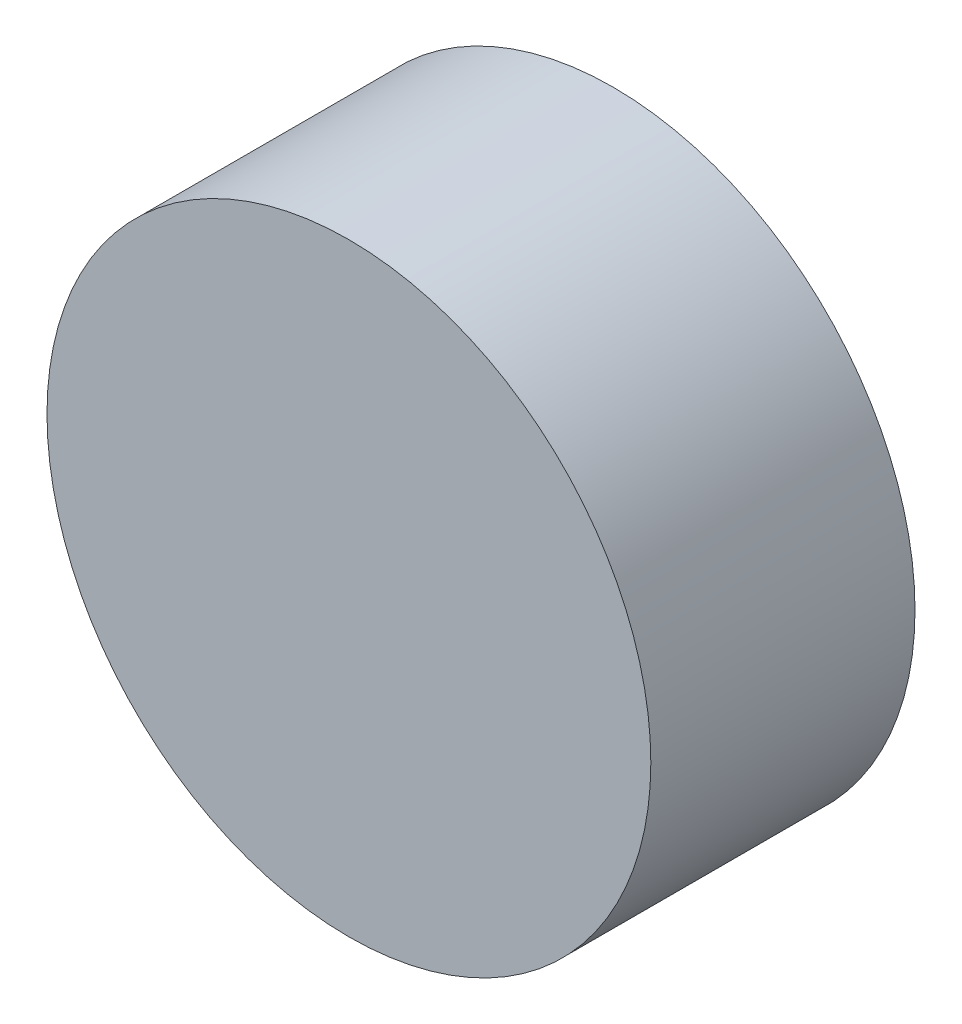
ISO-10303-21;
HEADER;
FILE_DESCRIPTION(('STEP AP214'),'2;1');
FILE_NAME('part.step','',(''),(''),'','','');
FILE_SCHEMA(('AUTOMOTIVE_DESIGN { 1 0 10303 214 1 1 1 1 }'));
ENDSEC;
DATA;
#1=APPLICATION_CONTEXT('core data for automotive mechanical design processes');
#2=APPLICATION_PROTOCOL_DEFINITION('international standard','automotive_design',2000,#1);
#3=PRODUCT_CONTEXT('',#1,'mechanical');
#4=PRODUCT('Part','Part','',(#3));
#5=PRODUCT_RELATED_PRODUCT_CATEGORY('part','',(#4));
#6=PRODUCT_DEFINITION_FORMATION('','',#4);
#7=PRODUCT_DEFINITION_CONTEXT('part definition',#1,'design');
#8=PRODUCT_DEFINITION('design','',#6,#7);
#9=PRODUCT_DEFINITION_SHAPE('','',#8);
#10=(LENGTH_UNIT() NAMED_UNIT(*) SI_UNIT(.MILLI.,.METRE.));
#11=(NAMED_UNIT(*) PLANE_ANGLE_UNIT() SI_UNIT($,.RADIAN.));
#12=(NAMED_UNIT(*) SI_UNIT($,.STERADIAN.) SOLID_ANGLE_UNIT());
#13=UNCERTAINTY_MEASURE_WITH_UNIT(LENGTH_MEASURE(1.E-05),#10,'distance_accuracy_value','');
#14=(GEOMETRIC_REPRESENTATION_CONTEXT(3) GLOBAL_UNCERTAINTY_ASSIGNED_CONTEXT((#13)) GLOBAL_UNIT_ASSIGNED_CONTEXT((#10,
#11,#12)) REPRESENTATION_CONTEXT('',''));
#15=CARTESIAN_POINT('',(0.,0.,0.));
#16=DIRECTION('',(0.,0.,1.));
#17=DIRECTION('',(1.,0.,0.));
#18=AXIS2_PLACEMENT_3D('',#15,#16,#17);
#19=CARTESIAN_POINT('',(0.,0.,3.5));
#20=DIRECTION('',(0.,0.,-1.));
#21=DIRECTION('',(-1.,0.,0.));
#22=AXIS2_PLACEMENT_3D('',#19,#20,#21);
#23=CYLINDRICAL_SURFACE('',#22,4.);
#24=CARTESIAN_POINT('',(0.,0.,3.5));
#25=DIRECTION('',(0.,0.,1.));
#26=DIRECTION('',(1.,0.,0.));
#27=AXIS2_PLACEMENT_3D('',#24,#25,#26);
#28=CIRCLE('',#27,4.);
#29=CARTESIAN_POINT('',(4.,0.,3.5));
#30=VERTEX_POINT('',#29);
#31=EDGE_CURVE('E10',#30,#30,#28,.T.);
#32=ORIENTED_EDGE('',*,*,#31,.F.);
#33=EDGE_LOOP('',(#32));
#34=FACE_BOUND('',#33,.T.);
#35=CARTESIAN_POINT('',(0.,0.,0.));
#36=DIRECTION('',(0.,0.,1.));
#37=DIRECTION('',(1.,0.,0.));
#38=AXIS2_PLACEMENT_3D('',#35,#36,#37);
#39=CIRCLE('',#38,4.);
#40=CARTESIAN_POINT('',(4.,0.,0.));
#41=VERTEX_POINT('',#40);
#42=EDGE_CURVE('E40',#41,#41,#39,.T.);
#43=ORIENTED_EDGE('',*,*,#42,.T.);
#44=EDGE_LOOP('',(#43));
#45=FACE_BOUND('',#44,.T.);
#46=ADVANCED_FACE('F37',(#34,#45),#23,.T.);
#47=CARTESIAN_POINT('',(0.,0.,3.5));
#48=DIRECTION('',(0.,0.,1.));
#49=DIRECTION('',(1.,0.,0.));
#50=AXIS2_PLACEMENT_3D('',#47,#48,#49);
#51=PLANE('',#50);
#52=ORIENTED_EDGE('',*,*,#31,.T.);
#53=EDGE_LOOP('',(#52));
#54=FACE_BOUND('',#53,.T.);
#55=ADVANCED_FACE('F52',(#54),#51,.T.);
#56=CARTESIAN_POINT('',(0.,0.,0.));
#57=DIRECTION('',(0.,0.,1.));
#58=DIRECTION('',(1.,0.,0.));
#59=AXIS2_PLACEMENT_3D('',#56,#57,#58);
#60=PLANE('',#59);
#61=ORIENTED_EDGE('',*,*,#42,.F.);
#62=EDGE_LOOP('',(#61));
#63=FACE_BOUND('',#62,.T.);
#64=ADVANCED_FACE('F50',(#63),#60,.F.);
#65=CLOSED_SHELL('',(#46,#55,#64));
#66=MANIFOLD_SOLID_BREP('B2',#65);
#67=ADVANCED_BREP_SHAPE_REPRESENTATION('',(#18,#66),#14);
#68=SHAPE_DEFINITION_REPRESENTATION(#9,#67);
ENDSEC;
END-ISO-10303-21;
